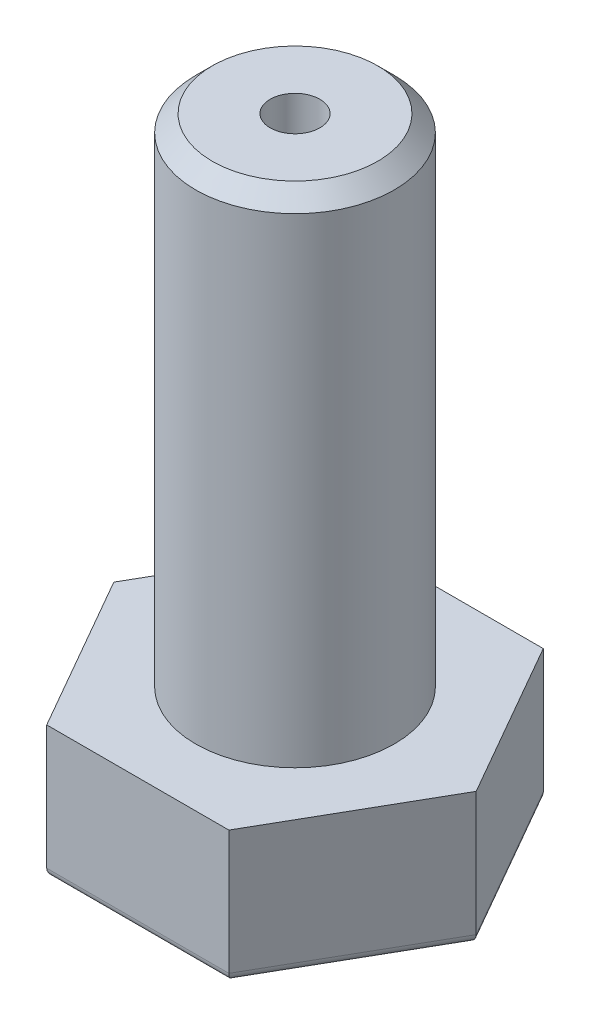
ISO-10303-21;
HEADER;
FILE_DESCRIPTION(('STEP AP214'),'2;1');
FILE_NAME('part.step','',(''),(''),'','','');
FILE_SCHEMA(('AUTOMOTIVE_DESIGN { 1 0 10303 214 1 1 1 1 }'));
ENDSEC;
DATA;
#1=APPLICATION_CONTEXT('core data for automotive mechanical design processes');
#2=APPLICATION_PROTOCOL_DEFINITION('international standard','automotive_design',2000,#1);
#3=PRODUCT_CONTEXT('',#1,'mechanical');
#4=PRODUCT('Part','Part','',(#3));
#5=PRODUCT_RELATED_PRODUCT_CATEGORY('part','',(#4));
#6=PRODUCT_DEFINITION_FORMATION('','',#4);
#7=PRODUCT_DEFINITION_CONTEXT('part definition',#1,'design');
#8=PRODUCT_DEFINITION('design','',#6,#7);
#9=PRODUCT_DEFINITION_SHAPE('','',#8);
#10=(LENGTH_UNIT() NAMED_UNIT(*) SI_UNIT(.MILLI.,.METRE.));
#11=(NAMED_UNIT(*) PLANE_ANGLE_UNIT() SI_UNIT($,.RADIAN.));
#12=(NAMED_UNIT(*) SI_UNIT($,.STERADIAN.) SOLID_ANGLE_UNIT());
#13=UNCERTAINTY_MEASURE_WITH_UNIT(LENGTH_MEASURE(1.E-05),#10,'distance_accuracy_value','');
#14=(GEOMETRIC_REPRESENTATION_CONTEXT(3) GLOBAL_UNCERTAINTY_ASSIGNED_CONTEXT((#13)) GLOBAL_UNIT_ASSIGNED_CONTEXT((#10,
#11,#12)) REPRESENTATION_CONTEXT('',''));
#15=CARTESIAN_POINT('',(0.,0.,0.));
#16=DIRECTION('',(0.,0.,1.));
#17=DIRECTION('',(1.,0.,0.));
#18=AXIS2_PLACEMENT_3D('',#15,#16,#17);
#19=CARTESIAN_POINT('',(5.50458908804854,8.,9.5));
#20=DIRECTION('',(0.,1.,0.));
#21=DIRECTION('',(0.,0.,1.));
#22=AXIS2_PLACEMENT_3D('',#19,#20,#21);
#23=PLANE('',#22);
#24=DIRECTION('',(1.,0.,0.));
#25=VECTOR('',#24,1.);
#26=CARTESIAN_POINT('',(-5.50458908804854,8.,9.5));
#27=LINE('',#26,#25);
#28=CARTESIAN_POINT('',(-5.50458908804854,8.,9.5));
#29=VERTEX_POINT('',#28);
#30=CARTESIAN_POINT('',(5.50458908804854,8.,9.5));
#31=VERTEX_POINT('',#30);
#32=EDGE_CURVE('E111',#29,#31,#27,.T.);
#33=ORIENTED_EDGE('',*,*,#32,.T.);
#34=DIRECTION('',(0.497297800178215,0.,-0.867579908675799));
#35=VECTOR('',#34,1.);
#36=CARTESIAN_POINT('',(5.50458908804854,8.,9.5));
#37=LINE('',#36,#35);
#38=CARTESIAN_POINT('',(10.95,8.,0.));
#39=VERTEX_POINT('',#38);
#40=EDGE_CURVE('E103',#31,#39,#37,.T.);
#41=ORIENTED_EDGE('',*,*,#40,.T.);
#42=DIRECTION('',(-0.497297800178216,0.,-0.867579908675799));
#43=VECTOR('',#42,1.);
#44=CARTESIAN_POINT('',(5.50458908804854,8.,-9.5));
#45=LINE('',#44,#43);
#46=CARTESIAN_POINT('',(5.50458908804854,8.,-9.5));
#47=VERTEX_POINT('',#46);
#48=EDGE_CURVE('E110',#39,#47,#45,.T.);
#49=ORIENTED_EDGE('',*,*,#48,.T.);
#50=DIRECTION('',(-1.,0.,0.));
#51=VECTOR('',#50,1.);
#52=CARTESIAN_POINT('',(-5.50458908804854,8.,-9.5));
#53=LINE('',#52,#51);
#54=CARTESIAN_POINT('',(-5.50458908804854,8.,-9.5));
#55=VERTEX_POINT('',#54);
#56=EDGE_CURVE('E370',#47,#55,#53,.T.);
#57=ORIENTED_EDGE('',*,*,#56,.T.);
#58=DIRECTION('',(-0.497297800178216,0.,0.867579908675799));
#59=VECTOR('',#58,1.);
#60=CARTESIAN_POINT('',(-5.50458908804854,8.,-9.5));
#61=LINE('',#60,#59);
#62=CARTESIAN_POINT('',(-10.95,8.,0.));
#63=VERTEX_POINT('',#62);
#64=EDGE_CURVE('E372',#55,#63,#61,.T.);
#65=ORIENTED_EDGE('',*,*,#64,.T.);
#66=DIRECTION('',(0.497297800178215,0.,0.867579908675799));
#67=VECTOR('',#66,1.);
#68=CARTESIAN_POINT('',(-5.50458908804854,8.,9.5));
#69=LINE('',#68,#67);
#70=EDGE_CURVE('E116',#63,#29,#69,.T.);
#71=ORIENTED_EDGE('',*,*,#70,.T.);
#72=EDGE_LOOP('',(#33,#41,#49,#57,#65,#71));
#73=FACE_BOUND('',#72,.T.);
#74=CARTESIAN_POINT('',(0.,8.,0.));
#75=DIRECTION('',(0.,1.,0.));
#76=DIRECTION('',(0.,0.,1.));
#77=AXIS2_PLACEMENT_3D('',#74,#75,#76);
#78=CIRCLE('',#77,6.);
#79=CARTESIAN_POINT('',(0.,8.,6.));
#80=VERTEX_POINT('',#79);
#81=EDGE_CURVE('E351',#80,#80,#78,.T.);
#82=ORIENTED_EDGE('',*,*,#81,.F.);
#83=EDGE_LOOP('',(#82));
#84=FACE_BOUND('',#83,.T.);
#85=ADVANCED_FACE('F31',(#73,#84),#23,.T.);
#86=CARTESIAN_POINT('',(-5.50458908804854,8.,9.5));
#87=DIRECTION('',(0.,0.,-1.));
#88=DIRECTION('',(-1.,0.,0.));
#89=AXIS2_PLACEMENT_3D('',#86,#87,#88);
#90=PLANE('',#89);
#91=DIRECTION('',(0.,-1.,0.));
#92=VECTOR('',#91,1.);
#93=CARTESIAN_POINT('',(-5.50458908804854,8.,9.5));
#94=LINE('',#93,#92);
#95=CARTESIAN_POINT('',(-5.50458908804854,0.5,9.5));
#96=VERTEX_POINT('',#95);
#97=EDGE_CURVE('E375',#29,#96,#94,.T.);
#98=ORIENTED_EDGE('',*,*,#97,.T.);
#99=DIRECTION('',(1.,0.,0.));
#100=VECTOR('',#99,1.);
#101=CARTESIAN_POINT('',(-5.50458908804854,0.5,9.5));
#102=LINE('',#101,#100);
#103=CARTESIAN_POINT('',(5.50458908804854,0.5,9.5));
#104=VERTEX_POINT('',#103);
#105=EDGE_CURVE('E47',#96,#104,#102,.T.);
#106=ORIENTED_EDGE('',*,*,#105,.T.);
#107=DIRECTION('',(0.,-1.,0.));
#108=VECTOR('',#107,1.);
#109=CARTESIAN_POINT('',(5.50458908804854,8.,9.5));
#110=LINE('',#109,#108);
#111=EDGE_CURVE('E106',#31,#104,#110,.T.);
#112=ORIENTED_EDGE('',*,*,#111,.F.);
#113=ORIENTED_EDGE('',*,*,#32,.F.);
#114=EDGE_LOOP('',(#98,#106,#112,#113));
#115=FACE_BOUND('',#114,.T.);
#116=ADVANCED_FACE('F33',(#115),#90,.F.);
#117=CARTESIAN_POINT('',(5.50458908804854,8.,9.5));
#118=DIRECTION('',(-0.867579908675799,0.,-0.497297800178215));
#119=DIRECTION('',(-0.497297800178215,0.,0.867579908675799));
#120=AXIS2_PLACEMENT_3D('',#117,#118,#119);
#121=PLANE('',#120);
#122=ORIENTED_EDGE('',*,*,#111,.T.);
#123=DIRECTION('',(0.497297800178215,0.,-0.867579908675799));
#124=VECTOR('',#123,1.);
#125=CARTESIAN_POINT('',(5.50458908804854,0.499999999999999,9.5));
#126=LINE('',#125,#124);
#127=CARTESIAN_POINT('',(10.95,0.5,0.));
#128=VERTEX_POINT('',#127);
#129=EDGE_CURVE('E54',#104,#128,#126,.T.);
#130=ORIENTED_EDGE('',*,*,#129,.T.);
#131=DIRECTION('',(0.,-1.,0.));
#132=VECTOR('',#131,1.);
#133=CARTESIAN_POINT('',(10.95,8.,0.));
#134=LINE('',#133,#132);
#135=EDGE_CURVE('E107',#39,#128,#134,.T.);
#136=ORIENTED_EDGE('',*,*,#135,.F.);
#137=ORIENTED_EDGE('',*,*,#40,.F.);
#138=EDGE_LOOP('',(#122,#130,#136,#137));
#139=FACE_BOUND('',#138,.T.);
#140=ADVANCED_FACE('F105',(#139),#121,.F.);
#141=CARTESIAN_POINT('',(5.50458908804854,8.,-9.5));
#142=DIRECTION('',(-0.867579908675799,0.,0.497297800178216));
#143=DIRECTION('',(0.497297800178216,0.,0.867579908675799));
#144=AXIS2_PLACEMENT_3D('',#141,#142,#143);
#145=PLANE('',#144);
#146=ORIENTED_EDGE('',*,*,#135,.T.);
#147=DIRECTION('',(-0.497297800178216,0.,-0.867579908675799));
#148=VECTOR('',#147,1.);
#149=CARTESIAN_POINT('',(5.50458908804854,0.499999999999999,-9.5));
#150=LINE('',#149,#148);
#151=CARTESIAN_POINT('',(5.50458908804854,0.5,-9.5));
#152=VERTEX_POINT('',#151);
#153=EDGE_CURVE('E145',#128,#152,#150,.T.);
#154=ORIENTED_EDGE('',*,*,#153,.T.);
#155=DIRECTION('',(0.,-1.,0.));
#156=VECTOR('',#155,1.);
#157=CARTESIAN_POINT('',(5.50458908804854,8.,-9.5));
#158=LINE('',#157,#156);
#159=EDGE_CURVE('E125',#47,#152,#158,.T.);
#160=ORIENTED_EDGE('',*,*,#159,.F.);
#161=ORIENTED_EDGE('',*,*,#48,.F.);
#162=EDGE_LOOP('',(#146,#154,#160,#161));
#163=FACE_BOUND('',#162,.T.);
#164=ADVANCED_FACE('F190',(#163),#145,.F.);
#165=CARTESIAN_POINT('',(-5.50458908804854,8.,-9.5));
#166=DIRECTION('',(0.,0.,1.));
#167=DIRECTION('',(1.,0.,0.));
#168=AXIS2_PLACEMENT_3D('',#165,#166,#167);
#169=PLANE('',#168);
#170=ORIENTED_EDGE('',*,*,#159,.T.);
#171=DIRECTION('',(-1.,0.,0.));
#172=VECTOR('',#171,1.);
#173=CARTESIAN_POINT('',(-5.50458908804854,0.5,-9.5));
#174=LINE('',#173,#172);
#175=CARTESIAN_POINT('',(-5.50458908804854,0.5,-9.5));
#176=VERTEX_POINT('',#175);
#177=EDGE_CURVE('E143',#152,#176,#174,.T.);
#178=ORIENTED_EDGE('',*,*,#177,.T.);
#179=DIRECTION('',(0.,-1.,0.));
#180=VECTOR('',#179,1.);
#181=CARTESIAN_POINT('',(-5.50458908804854,8.,-9.5));
#182=LINE('',#181,#180);
#183=EDGE_CURVE('E380',#55,#176,#182,.T.);
#184=ORIENTED_EDGE('',*,*,#183,.F.);
#185=ORIENTED_EDGE('',*,*,#56,.F.);
#186=EDGE_LOOP('',(#170,#178,#184,#185));
#187=FACE_BOUND('',#186,.T.);
#188=ADVANCED_FACE('F186',(#187),#169,.F.);
#189=CARTESIAN_POINT('',(-5.50458908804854,8.,-9.5));
#190=DIRECTION('',(0.867579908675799,0.,0.497297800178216));
#191=DIRECTION('',(0.497297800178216,0.,-0.867579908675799));
#192=AXIS2_PLACEMENT_3D('',#189,#190,#191);
#193=PLANE('',#192);
#194=ORIENTED_EDGE('',*,*,#183,.T.);
#195=DIRECTION('',(-0.497297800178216,0.,0.867579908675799));
#196=VECTOR('',#195,1.);
#197=CARTESIAN_POINT('',(-5.50458908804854,0.499999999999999,-9.5));
#198=LINE('',#197,#196);
#199=CARTESIAN_POINT('',(-10.95,0.5,0.));
#200=VERTEX_POINT('',#199);
#201=EDGE_CURVE('E141',#176,#200,#198,.T.);
#202=ORIENTED_EDGE('',*,*,#201,.T.);
#203=DIRECTION('',(0.,-1.,0.));
#204=VECTOR('',#203,1.);
#205=CARTESIAN_POINT('',(-10.95,8.,0.));
#206=LINE('',#205,#204);
#207=EDGE_CURVE('E377',#63,#200,#206,.T.);
#208=ORIENTED_EDGE('',*,*,#207,.F.);
#209=ORIENTED_EDGE('',*,*,#64,.F.);
#210=EDGE_LOOP('',(#194,#202,#208,#209));
#211=FACE_BOUND('',#210,.T.);
#212=ADVANCED_FACE('F182',(#211),#193,.F.);
#213=CARTESIAN_POINT('',(-5.50458908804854,8.,9.5));
#214=DIRECTION('',(0.867579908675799,0.,-0.497297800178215));
#215=DIRECTION('',(-0.497297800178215,0.,-0.867579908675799));
#216=AXIS2_PLACEMENT_3D('',#213,#214,#215);
#217=PLANE('',#216);
#218=ORIENTED_EDGE('',*,*,#207,.T.);
#219=DIRECTION('',(0.497297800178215,0.,0.867579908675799));
#220=VECTOR('',#219,1.);
#221=CARTESIAN_POINT('',(-5.50458908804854,0.499999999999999,9.5));
#222=LINE('',#221,#220);
#223=EDGE_CURVE('E120',#200,#96,#222,.T.);
#224=ORIENTED_EDGE('',*,*,#223,.T.);
#225=ORIENTED_EDGE('',*,*,#97,.F.);
#226=ORIENTED_EDGE('',*,*,#70,.F.);
#227=EDGE_LOOP('',(#218,#224,#225,#226));
#228=FACE_BOUND('',#227,.T.);
#229=ADVANCED_FACE('F179',(#228),#217,.F.);
#230=CARTESIAN_POINT('',(5.50458908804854,0.,9.5));
#231=DIRECTION('',(0.,1.,0.));
#232=DIRECTION('',(0.,0.,1.));
#233=AXIS2_PLACEMENT_3D('',#230,#231,#232);
#234=PLANE('',#233);
#235=CARTESIAN_POINT('',(0.,0.,0.));
#236=DIRECTION('',(0.,-1.,0.));
#237=DIRECTION('',(0.,0.,-1.));
#238=AXIS2_PLACEMENT_3D('',#235,#236,#237);
#239=CIRCLE('',#238,4.);
#240=CARTESIAN_POINT('',(0.,0.,-4.));
#241=VERTEX_POINT('',#240);
#242=EDGE_CURVE('E342',#241,#241,#239,.T.);
#243=ORIENTED_EDGE('',*,*,#242,.F.);
#244=EDGE_LOOP('',(#243));
#245=FACE_BOUND('',#244,.T.);
#246=DIRECTION('',(1.,0.,0.));
#247=VECTOR('',#246,1.);
#248=CARTESIAN_POINT('',(5.50458908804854,0.,9.));
#249=LINE('',#248,#247);
#250=CARTESIAN_POINT('',(5.21487387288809,0.,9.));
#251=VERTEX_POINT('',#250);
#252=CARTESIAN_POINT('',(-5.21487387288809,0.,9.));
#253=VERTEX_POINT('',#252);
#254=EDGE_CURVE('E123',#251,#253,#249,.F.);
#255=ORIENTED_EDGE('',*,*,#254,.T.);
#256=DIRECTION('',(0.497297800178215,0.,0.867579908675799));
#257=VECTOR('',#256,1.);
#258=CARTESIAN_POINT('',(-2.3481732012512,0.,14.0012123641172));
#259=LINE('',#258,#257);
#260=CARTESIAN_POINT('',(-10.3736842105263,0.,0.));
#261=VERTEX_POINT('',#260);
#262=EDGE_CURVE('E138',#253,#261,#259,.F.);
#263=ORIENTED_EDGE('',*,*,#262,.T.);
#264=DIRECTION('',(-0.497297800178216,0.,0.867579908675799));
#265=VECTOR('',#264,1.);
#266=CARTESIAN_POINT('',(-10.5456392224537,0.,0.299990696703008));
#267=LINE('',#266,#265);
#268=CARTESIAN_POINT('',(-5.21487387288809,0.,-9.));
#269=VERTEX_POINT('',#268);
#270=EDGE_CURVE('E136',#261,#269,#267,.F.);
#271=ORIENTED_EDGE('',*,*,#270,.T.);
#272=DIRECTION('',(-1.,0.,0.));
#273=VECTOR('',#272,1.);
#274=CARTESIAN_POINT('',(5.50458908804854,0.,-9.));
#275=LINE('',#274,#273);
#276=CARTESIAN_POINT('',(5.21487387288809,0.,-9.));
#277=VERTEX_POINT('',#276);
#278=EDGE_CURVE('E134',#269,#277,#275,.F.);
#279=ORIENTED_EDGE('',*,*,#278,.T.);
#280=DIRECTION('',(-0.497297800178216,0.,-0.867579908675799));
#281=VECTOR('',#280,1.);
#282=CARTESIAN_POINT('',(13.2682651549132,0.,5.04985196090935));
#283=LINE('',#282,#281);
#284=CARTESIAN_POINT('',(10.3736842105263,0.,0.));
#285=VERTEX_POINT('',#284);
#286=EDGE_CURVE('E132',#277,#285,#283,.F.);
#287=ORIENTED_EDGE('',*,*,#286,.T.);
#288=DIRECTION('',(0.497297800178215,0.,-0.867579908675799));
#289=VECTOR('',#288,1.);
#290=CARTESIAN_POINT('',(5.07079913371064,0.,9.25135109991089));
#291=LINE('',#290,#289);
#292=EDGE_CURVE('E130',#285,#251,#291,.F.);
#293=ORIENTED_EDGE('',*,*,#292,.T.);
#294=EDGE_LOOP('',(#255,#263,#271,#279,#287,#293));
#295=FACE_BOUND('',#294,.T.);
#296=ADVANCED_FACE('F177',(#245,#295),#234,.F.);
#297=CARTESIAN_POINT('',(5.07079913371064,0.499999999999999,-9.25135109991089));
#298=DIRECTION('',(-0.497297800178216,0.,-0.867579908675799));
#299=DIRECTION('',(-0.867579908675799,0.,0.497297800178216));
#300=AXIS2_PLACEMENT_3D('',#297,#298,#299);
#301=CYLINDRICAL_SURFACE('',#300,0.5);
#302=CARTESIAN_POINT('',(10.3736842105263,0.499999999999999,0.));
#303=DIRECTION('',(0.,0.,-1.));
#304=DIRECTION('',(1.,0.,0.));
#305=AXIS2_PLACEMENT_3D('',#302,#303,#304);
#306=ELLIPSE('',#305,0.576315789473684,0.5);
#307=EDGE_CURVE('E364',#285,#128,#306,.F.);
#308=ORIENTED_EDGE('',*,*,#307,.F.);
#309=ORIENTED_EDGE('',*,*,#286,.F.);
#310=CARTESIAN_POINT('',(5.21487387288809,0.499999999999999,-9.));
#311=DIRECTION('',(-0.865244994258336,0.,-0.501349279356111));
#312=DIRECTION('',(0.501349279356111,0.,-0.865244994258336));
#313=AXIS2_PLACEMENT_3D('',#310,#311,#312);
#314=ELLIPSE('',#313,0.57787101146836,0.5);
#315=EDGE_CURVE('E118',#152,#277,#314,.T.);
#316=ORIENTED_EDGE('',*,*,#315,.F.);
#317=ORIENTED_EDGE('',*,*,#153,.F.);
#318=EDGE_LOOP('',(#308,#309,#316,#317));
#319=FACE_BOUND('',#318,.T.);
#320=ADVANCED_FACE('F222',(#319),#301,.T.);
#321=CARTESIAN_POINT('',(-5.50458908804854,0.5,-9.));
#322=DIRECTION('',(-1.,0.,0.));
#323=DIRECTION('',(0.,0.,1.));
#324=AXIS2_PLACEMENT_3D('',#321,#322,#323);
#325=CYLINDRICAL_SURFACE('',#324,0.5);
#326=ORIENTED_EDGE('',*,*,#315,.T.);
#327=ORIENTED_EDGE('',*,*,#278,.F.);
#328=CARTESIAN_POINT('',(-5.21487387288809,0.499999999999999,-9.));
#329=DIRECTION('',(-0.865244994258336,0.,0.501349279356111));
#330=DIRECTION('',(-0.501349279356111,0.,-0.865244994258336));
#331=AXIS2_PLACEMENT_3D('',#328,#329,#330);
#332=ELLIPSE('',#331,0.57787101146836,0.5);
#333=EDGE_CURVE('E361',#176,#269,#332,.T.);
#334=ORIENTED_EDGE('',*,*,#333,.F.);
#335=ORIENTED_EDGE('',*,*,#177,.F.);
#336=EDGE_LOOP('',(#326,#327,#334,#335));
#337=FACE_BOUND('',#336,.T.);
#338=ADVANCED_FACE('F230',(#337),#325,.T.);
#339=CARTESIAN_POINT('',(5.07079913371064,0.499999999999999,9.25135109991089));
#340=DIRECTION('',(0.497297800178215,0.,-0.867579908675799));
#341=DIRECTION('',(-0.867579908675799,0.,-0.497297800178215));
#342=AXIS2_PLACEMENT_3D('',#339,#340,#341);
#343=CYLINDRICAL_SURFACE('',#342,0.5);
#344=ORIENTED_EDGE('',*,*,#307,.T.);
#345=ORIENTED_EDGE('',*,*,#129,.F.);
#346=CARTESIAN_POINT('',(5.21487387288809,0.499999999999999,9.));
#347=DIRECTION('',(0.865244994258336,0.,-0.501349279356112));
#348=DIRECTION('',(0.501349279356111,0.,0.865244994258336));
#349=AXIS2_PLACEMENT_3D('',#346,#347,#348);
#350=ELLIPSE('',#349,0.57787101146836,0.5);
#351=EDGE_CURVE('E358',#251,#104,#350,.F.);
#352=ORIENTED_EDGE('',*,*,#351,.F.);
#353=ORIENTED_EDGE('',*,*,#292,.F.);
#354=EDGE_LOOP('',(#344,#345,#352,#353));
#355=FACE_BOUND('',#354,.T.);
#356=ADVANCED_FACE('F237',(#355),#343,.T.);
#357=CARTESIAN_POINT('',(-5.07079913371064,0.499999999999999,-9.25135109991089));
#358=DIRECTION('',(-0.497297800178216,0.,0.867579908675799));
#359=DIRECTION('',(0.867579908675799,0.,0.497297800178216));
#360=AXIS2_PLACEMENT_3D('',#357,#358,#359);
#361=CYLINDRICAL_SURFACE('',#360,0.5);
#362=ORIENTED_EDGE('',*,*,#333,.T.);
#363=ORIENTED_EDGE('',*,*,#270,.F.);
#364=CARTESIAN_POINT('',(-10.3736842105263,0.499999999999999,0.));
#365=DIRECTION('',(0.,0.,1.));
#366=DIRECTION('',(-1.,0.,0.));
#367=AXIS2_PLACEMENT_3D('',#364,#365,#366);
#368=ELLIPSE('',#367,0.576315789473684,0.5);
#369=EDGE_CURVE('E356',#200,#261,#368,.T.);
#370=ORIENTED_EDGE('',*,*,#369,.F.);
#371=ORIENTED_EDGE('',*,*,#201,.F.);
#372=EDGE_LOOP('',(#362,#363,#370,#371));
#373=FACE_BOUND('',#372,.T.);
#374=ADVANCED_FACE('F245',(#373),#361,.T.);
#375=CARTESIAN_POINT('',(-5.50458908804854,0.5,9.));
#376=DIRECTION('',(1.,0.,0.));
#377=DIRECTION('',(0.,0.,-1.));
#378=AXIS2_PLACEMENT_3D('',#375,#376,#377);
#379=CYLINDRICAL_SURFACE('',#378,0.5);
#380=ORIENTED_EDGE('',*,*,#351,.T.);
#381=ORIENTED_EDGE('',*,*,#105,.F.);
#382=CARTESIAN_POINT('',(-5.21487387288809,0.499999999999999,9.));
#383=DIRECTION('',(0.865244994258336,0.,0.501349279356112));
#384=DIRECTION('',(0.501349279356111,0.,-0.865244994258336));
#385=AXIS2_PLACEMENT_3D('',#382,#383,#384);
#386=ELLIPSE('',#385,0.57787101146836,0.5);
#387=EDGE_CURVE('E354',#253,#96,#386,.F.);
#388=ORIENTED_EDGE('',*,*,#387,.F.);
#389=ORIENTED_EDGE('',*,*,#254,.F.);
#390=EDGE_LOOP('',(#380,#381,#388,#389));
#391=FACE_BOUND('',#390,.T.);
#392=ADVANCED_FACE('F253',(#391),#379,.T.);
#393=CARTESIAN_POINT('',(-5.07079913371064,0.499999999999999,9.25135109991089));
#394=DIRECTION('',(0.497297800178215,0.,0.867579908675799));
#395=DIRECTION('',(0.867579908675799,0.,-0.497297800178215));
#396=AXIS2_PLACEMENT_3D('',#393,#394,#395);
#397=CYLINDRICAL_SURFACE('',#396,0.5);
#398=ORIENTED_EDGE('',*,*,#369,.T.);
#399=ORIENTED_EDGE('',*,*,#262,.F.);
#400=ORIENTED_EDGE('',*,*,#387,.T.);
#401=ORIENTED_EDGE('',*,*,#223,.F.);
#402=EDGE_LOOP('',(#398,#399,#400,#401));
#403=FACE_BOUND('',#402,.T.);
#404=ADVANCED_FACE('F261',(#403),#397,.T.);
#405=CARTESIAN_POINT('',(0.,38.,0.));
#406=DIRECTION('',(0.,-1.,0.));
#407=DIRECTION('',(0.,0.,-1.));
#408=AXIS2_PLACEMENT_3D('',#405,#406,#407);
#409=CYLINDRICAL_SURFACE('',#408,6.);
#410=CARTESIAN_POINT('',(0.,37.,0.));
#411=DIRECTION('',(0.,1.,0.));
#412=DIRECTION('',(0.,0.,1.));
#413=AXIS2_PLACEMENT_3D('',#410,#411,#412);
#414=CIRCLE('',#413,6.);
#415=CARTESIAN_POINT('',(0.,37.,6.));
#416=VERTEX_POINT('',#415);
#417=EDGE_CURVE('E11',#416,#416,#414,.F.);
#418=ORIENTED_EDGE('',*,*,#417,.T.);
#419=EDGE_LOOP('',(#418));
#420=FACE_BOUND('',#419,.T.);
#421=ORIENTED_EDGE('',*,*,#81,.T.);
#422=EDGE_LOOP('',(#421));
#423=FACE_BOUND('',#422,.T.);
#424=ADVANCED_FACE('F166',(#420,#423),#409,.T.);
#425=CARTESIAN_POINT('',(0.,38.,0.));
#426=DIRECTION('',(0.,1.,0.));
#427=DIRECTION('',(0.,0.,1.));
#428=AXIS2_PLACEMENT_3D('',#425,#426,#427);
#429=PLANE('',#428);
#430=CARTESIAN_POINT('',(0.,38.,0.));
#431=DIRECTION('',(0.,1.,0.));
#432=DIRECTION('',(0.,0.,1.));
#433=AXIS2_PLACEMENT_3D('',#430,#431,#432);
#434=CIRCLE('',#433,1.49999999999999);
#435=CARTESIAN_POINT('',(0.,38.,1.49999999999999));
#436=VERTEX_POINT('',#435);
#437=EDGE_CURVE('E348',#436,#436,#434,.T.);
#438=ORIENTED_EDGE('',*,*,#437,.F.);
#439=EDGE_LOOP('',(#438));
#440=FACE_BOUND('',#439,.T.);
#441=CARTESIAN_POINT('',(0.,38.,0.));
#442=DIRECTION('',(0.,1.,0.));
#443=DIRECTION('',(0.,0.,1.));
#444=AXIS2_PLACEMENT_3D('',#441,#442,#443);
#445=CIRCLE('',#444,5.);
#446=CARTESIAN_POINT('',(0.,38.,5.));
#447=VERTEX_POINT('',#446);
#448=EDGE_CURVE('E40',#447,#447,#445,.T.);
#449=ORIENTED_EDGE('',*,*,#448,.T.);
#450=EDGE_LOOP('',(#449));
#451=FACE_BOUND('',#450,.T.);
#452=ADVANCED_FACE('F152',(#440,#451),#429,.T.);
#453=CARTESIAN_POINT('',(0.,38.,0.));
#454=DIRECTION('',(0.,-1.,0.));
#455=DIRECTION('',(0.,0.,-1.));
#456=AXIS2_PLACEMENT_3D('',#453,#454,#455);
#457=CONICAL_SURFACE('',#456,5.,0.785398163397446);
#458=ORIENTED_EDGE('',*,*,#417,.F.);
#459=EDGE_LOOP('',(#458));
#460=FACE_BOUND('',#459,.T.);
#461=ORIENTED_EDGE('',*,*,#448,.F.);
#462=EDGE_LOOP('',(#461));
#463=FACE_BOUND('',#462,.T.);
#464=ADVANCED_FACE('F154',(#460,#463),#457,.T.);
#465=CARTESIAN_POINT('',(0.,38.,0.));
#466=DIRECTION('',(0.,1.,0.));
#467=DIRECTION('',(0.,0.,1.));
#468=AXIS2_PLACEMENT_3D('',#465,#466,#467);
#469=CYLINDRICAL_SURFACE('',#468,1.49999999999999);
#470=CARTESIAN_POINT('',(0.,10.8916351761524,0.));
#471=DIRECTION('',(0.,-1.,0.));
#472=DIRECTION('',(0.,0.,-1.));
#473=AXIS2_PLACEMENT_3D('',#470,#471,#472);
#474=CIRCLE('',#473,1.49999999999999);
#475=CARTESIAN_POINT('',(0.,10.8916351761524,-1.49999999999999));
#476=VERTEX_POINT('',#475);
#477=EDGE_CURVE('E35',#476,#476,#474,.T.);
#478=ORIENTED_EDGE('',*,*,#477,.T.);
#479=EDGE_LOOP('',(#478));
#480=FACE_BOUND('',#479,.T.);
#481=ORIENTED_EDGE('',*,*,#437,.T.);
#482=EDGE_LOOP('',(#481));
#483=FACE_BOUND('',#482,.T.);
#484=ADVANCED_FACE('F156',(#480,#483),#469,.F.);
#485=CARTESIAN_POINT('',(0.,9.75,0.));
#486=DIRECTION('',(0.,-1.,0.));
#487=DIRECTION('',(0.,0.,-1.));
#488=AXIS2_PLACEMENT_3D('',#485,#486,#487);
#489=CONICAL_SURFACE('',#488,3.4,1.02974425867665);
#490=CARTESIAN_POINT('',(0.,9.75,0.));
#491=DIRECTION('',(0.,-1.,0.));
#492=DIRECTION('',(0.,0.,-1.));
#493=AXIS2_PLACEMENT_3D('',#490,#491,#492);
#494=CIRCLE('',#493,3.4);
#495=CARTESIAN_POINT('',(0.,9.75,-3.4));
#496=VERTEX_POINT('',#495);
#497=EDGE_CURVE('E335',#496,#496,#494,.T.);
#498=ORIENTED_EDGE('',*,*,#497,.T.);
#499=EDGE_LOOP('',(#498));
#500=FACE_BOUND('',#499,.T.);
#501=ORIENTED_EDGE('',*,*,#477,.F.);
#502=EDGE_LOOP('',(#501));
#503=FACE_BOUND('',#502,.T.);
#504=ADVANCED_FACE('F163',(#500,#503),#489,.F.);
#505=CARTESIAN_POINT('',(0.,0.,0.));
#506=DIRECTION('',(0.,-1.,0.));
#507=DIRECTION('',(0.,0.,-1.));
#508=AXIS2_PLACEMENT_3D('',#505,#506,#507);
#509=CYLINDRICAL_SURFACE('',#508,4.);
#510=CARTESIAN_POINT('',(0.,6.,0.));
#511=DIRECTION('',(0.,-1.,0.));
#512=DIRECTION('',(0.,0.,-1.));
#513=AXIS2_PLACEMENT_3D('',#510,#511,#512);
#514=CIRCLE('',#513,4.);
#515=CARTESIAN_POINT('',(0.,6.,-4.));
#516=VERTEX_POINT('',#515);
#517=EDGE_CURVE('E339',#516,#516,#514,.T.);
#518=ORIENTED_EDGE('',*,*,#517,.F.);
#519=EDGE_LOOP('',(#518));
#520=FACE_BOUND('',#519,.T.);
#521=ORIENTED_EDGE('',*,*,#242,.T.);
#522=EDGE_LOOP('',(#521));
#523=FACE_BOUND('',#522,.T.);
#524=ADVANCED_FACE('F298',(#520,#523),#509,.F.);
#525=CARTESIAN_POINT('',(3.4,6.,0.));
#526=DIRECTION('',(0.,1.,0.));
#527=DIRECTION('',(0.,0.,1.));
#528=AXIS2_PLACEMENT_3D('',#525,#526,#527);
#529=PLANE('',#528);
#530=CARTESIAN_POINT('',(0.,6.,0.));
#531=DIRECTION('',(0.,-1.,0.));
#532=DIRECTION('',(0.,0.,-1.));
#533=AXIS2_PLACEMENT_3D('',#530,#531,#532);
#534=CIRCLE('',#533,3.4);
#535=CARTESIAN_POINT('',(0.,6.,-3.4));
#536=VERTEX_POINT('',#535);
#537=EDGE_CURVE('E338',#536,#536,#534,.T.);
#538=ORIENTED_EDGE('',*,*,#537,.F.);
#539=EDGE_LOOP('',(#538));
#540=FACE_BOUND('',#539,.T.);
#541=ORIENTED_EDGE('',*,*,#517,.T.);
#542=EDGE_LOOP('',(#541));
#543=FACE_BOUND('',#542,.T.);
#544=ADVANCED_FACE('F307',(#540,#543),#529,.F.);
#545=CARTESIAN_POINT('',(0.,0.,0.));
#546=DIRECTION('',(0.,-1.,0.));
#547=DIRECTION('',(0.,0.,-1.));
#548=AXIS2_PLACEMENT_3D('',#545,#546,#547);
#549=CYLINDRICAL_SURFACE('',#548,3.4);
#550=ORIENTED_EDGE('',*,*,#497,.F.);
#551=EDGE_LOOP('',(#550));
#552=FACE_BOUND('',#551,.T.);
#553=ORIENTED_EDGE('',*,*,#537,.T.);
#554=EDGE_LOOP('',(#553));
#555=FACE_BOUND('',#554,.T.);
#556=ADVANCED_FACE('F316',(#552,#555),#549,.F.);
#557=CLOSED_SHELL('',(#85,#116,#140,#164,#188,#212,#229,#296,#320,#338,#356,#374,#392,#404,#424,
#452,#464,#484,#504,#524,#544,#556));
#558=MANIFOLD_SOLID_BREP('B2',#557);
#559=ADVANCED_BREP_SHAPE_REPRESENTATION('',(#18,#558),#14);
#560=SHAPE_DEFINITION_REPRESENTATION(#9,#559);
ENDSEC;
END-ISO-10303-21;
